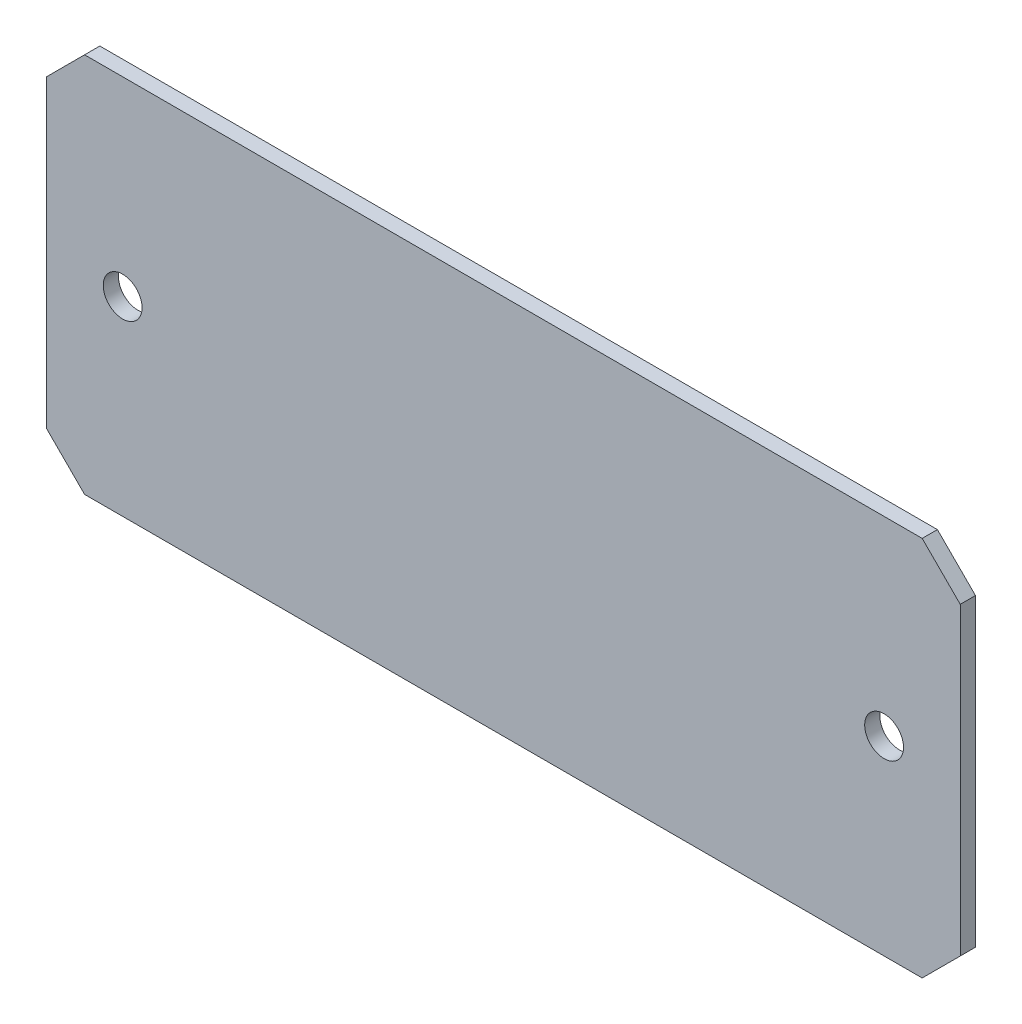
from build123d import *

# Parameters (mm, degrees)
ESQUISSE1_W            = 240
ESQUISSE1_H            = 100
EXTRUSION1_DEPTH       = 4
CHANFREIN1_SIZE        = 10
TROU_TARAUD_M122_D     = 10.2
TROU_TARAUD_M122_DEPTH = 29.25
TROU_TARAUD_M122_TIP   = 3.064389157


with BuildPart() as part:
    # Esquisse1 → Extrusion1 (new body)
    with BuildSketch(Plane.XY):
        with Locations((120, 50)):
            Rectangle(ESQUISSE1_W, ESQUISSE1_H)
    extrude(amount=EXTRUSION1_DEPTH)

    # Chanfrein1
    chanfrein1_edges = [part.edges().sort_by_distance(p)[0] for p in [
        (0, 100, 2),
        (240, 100, 2),
        (240, 0, 2),
        (0, 0, 2),
    ]]
    chamfer(chanfrein1_edges, length=CHANFREIN1_SIZE)

    # Trou taraud_ M122
    with Locations(Plane(origin=(20, 50, 4), x_dir=(1, 0, 0), z_dir=(0, 0, 1))):
        with Locations((0, 0), (200, 0)):
            Hole(TROU_TARAUD_M122_D / 2, depth=TROU_TARAUD_M122_DEPTH)
            with Locations((0, 0, -(TROU_TARAUD_M122_DEPTH + TROU_TARAUD_M122_TIP / 2))):  # 118° drill point
                Cone(0, TROU_TARAUD_M122_D / 2, TROU_TARAUD_M122_TIP, mode=Mode.SUBTRACT)


solid = part.part
